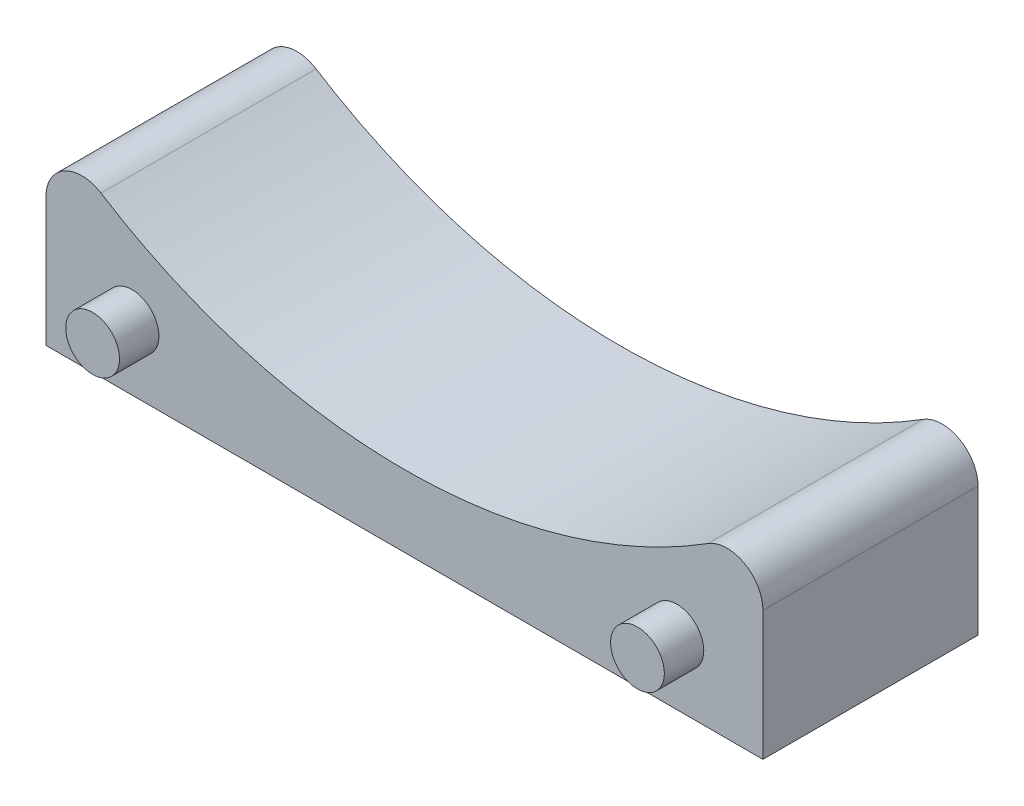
ISO-10303-21;
HEADER;
FILE_DESCRIPTION(('STEP AP214'),'2;1');
FILE_NAME('part.step','',(''),(''),'','','');
FILE_SCHEMA(('AUTOMOTIVE_DESIGN { 1 0 10303 214 1 1 1 1 }'));
ENDSEC;
DATA;
#1=APPLICATION_CONTEXT('core data for automotive mechanical design processes');
#2=APPLICATION_PROTOCOL_DEFINITION('international standard','automotive_design',2000,#1);
#3=PRODUCT_CONTEXT('',#1,'mechanical');
#4=PRODUCT('Part','Part','',(#3));
#5=PRODUCT_RELATED_PRODUCT_CATEGORY('part','',(#4));
#6=PRODUCT_DEFINITION_FORMATION('','',#4);
#7=PRODUCT_DEFINITION_CONTEXT('part definition',#1,'design');
#8=PRODUCT_DEFINITION('design','',#6,#7);
#9=PRODUCT_DEFINITION_SHAPE('','',#8);
#10=(LENGTH_UNIT() NAMED_UNIT(*) SI_UNIT(.MILLI.,.METRE.));
#11=(NAMED_UNIT(*) PLANE_ANGLE_UNIT() SI_UNIT($,.RADIAN.));
#12=(NAMED_UNIT(*) SI_UNIT($,.STERADIAN.) SOLID_ANGLE_UNIT());
#13=UNCERTAINTY_MEASURE_WITH_UNIT(LENGTH_MEASURE(1.E-05),#10,'distance_accuracy_value','');
#14=(GEOMETRIC_REPRESENTATION_CONTEXT(3) GLOBAL_UNCERTAINTY_ASSIGNED_CONTEXT((#13)) GLOBAL_UNIT_ASSIGNED_CONTEXT((#10,
#11,#12)) REPRESENTATION_CONTEXT('',''));
#15=CARTESIAN_POINT('',(0.,0.,0.));
#16=DIRECTION('',(0.,0.,1.));
#17=DIRECTION('',(1.,0.,0.));
#18=AXIS2_PLACEMENT_3D('',#15,#16,#17);
#19=CARTESIAN_POINT('',(0.,0.,0.));
#20=DIRECTION('',(0.,1.,0.));
#21=DIRECTION('',(0.,0.,1.));
#22=AXIS2_PLACEMENT_3D('',#19,#20,#21);
#23=PLANE('',#22);
#24=DIRECTION('',(0.,0.,-1.));
#25=VECTOR('',#24,1.);
#26=CARTESIAN_POINT('',(-50.,0.,144.));
#27=LINE('',#26,#25);
#28=CARTESIAN_POINT('',(-50.,0.,100.));
#29=VERTEX_POINT('',#28);
#30=CARTESIAN_POINT('',(-50.,0.,70.));
#31=VERTEX_POINT('',#30);
#32=EDGE_CURVE('E106',#29,#31,#27,.T.);
#33=ORIENTED_EDGE('',*,*,#32,.T.);
#34=DIRECTION('',(1.,0.,0.));
#35=VECTOR('',#34,1.);
#36=CARTESIAN_POINT('',(0.,0.,70.));
#37=LINE('',#36,#35);
#38=CARTESIAN_POINT('',(50.,0.,70.));
#39=VERTEX_POINT('',#38);
#40=EDGE_CURVE('E129',#31,#39,#37,.T.);
#41=ORIENTED_EDGE('',*,*,#40,.T.);
#42=DIRECTION('',(0.,0.,-1.));
#43=VECTOR('',#42,1.);
#44=CARTESIAN_POINT('',(50.,0.,144.));
#45=LINE('',#44,#43);
#46=CARTESIAN_POINT('',(50.,0.,100.));
#47=VERTEX_POINT('',#46);
#48=EDGE_CURVE('E109',#47,#39,#45,.T.);
#49=ORIENTED_EDGE('',*,*,#48,.F.);
#50=DIRECTION('',(1.,0.,0.));
#51=VECTOR('',#50,1.);
#52=CARTESIAN_POINT('',(0.,0.,100.));
#53=LINE('',#52,#51);
#54=EDGE_CURVE('E118',#29,#47,#53,.T.);
#55=ORIENTED_EDGE('',*,*,#54,.F.);
#56=EDGE_LOOP('',(#33,#41,#49,#55));
#57=FACE_BOUND('',#56,.T.);
#58=ADVANCED_FACE('F35',(#57),#23,.F.);
#59=CARTESIAN_POINT('',(-50.,24.,144.));
#60=DIRECTION('',(1.,0.,0.));
#61=DIRECTION('',(0.,0.,-1.));
#62=AXIS2_PLACEMENT_3D('',#59,#60,#61);
#63=PLANE('',#62);
#64=DIRECTION('',(0.,0.,1.));
#65=VECTOR('',#64,1.);
#66=CARTESIAN_POINT('',(-50.,18.0115182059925,134.437685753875));
#67=LINE('',#66,#65);
#68=CARTESIAN_POINT('',(-50.,18.0115182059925,100.));
#69=VERTEX_POINT('',#68);
#70=CARTESIAN_POINT('',(-50.,18.0115182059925,70.));
#71=VERTEX_POINT('',#70);
#72=EDGE_CURVE('E99',#69,#71,#67,.F.);
#73=ORIENTED_EDGE('',*,*,#72,.T.);
#74=DIRECTION('',(0.,-1.,0.));
#75=VECTOR('',#74,1.);
#76=CARTESIAN_POINT('',(-50.,24.,70.));
#77=LINE('',#76,#75);
#78=EDGE_CURVE('E49',#71,#31,#77,.T.);
#79=ORIENTED_EDGE('',*,*,#78,.T.);
#80=ORIENTED_EDGE('',*,*,#32,.F.);
#81=DIRECTION('',(0.,-1.,0.));
#82=VECTOR('',#81,1.);
#83=CARTESIAN_POINT('',(-50.,24.,100.));
#84=LINE('',#83,#82);
#85=EDGE_CURVE('E120',#69,#29,#84,.T.);
#86=ORIENTED_EDGE('',*,*,#85,.F.);
#87=EDGE_LOOP('',(#73,#79,#80,#86));
#88=FACE_BOUND('',#87,.T.);
#89=ADVANCED_FACE('F189',(#88),#63,.F.);
#90=CARTESIAN_POINT('',(50.,0.,144.));
#91=DIRECTION('',(-1.,0.,0.));
#92=DIRECTION('',(0.,0.,1.));
#93=AXIS2_PLACEMENT_3D('',#90,#91,#92);
#94=PLANE('',#93);
#95=ORIENTED_EDGE('',*,*,#48,.T.);
#96=DIRECTION('',(0.,1.,0.));
#97=VECTOR('',#96,1.);
#98=CARTESIAN_POINT('',(50.,0.,70.));
#99=LINE('',#98,#97);
#100=CARTESIAN_POINT('',(50.,18.0115182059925,70.));
#101=VERTEX_POINT('',#100);
#102=EDGE_CURVE('E124',#39,#101,#99,.T.);
#103=ORIENTED_EDGE('',*,*,#102,.T.);
#104=DIRECTION('',(0.,0.,1.));
#105=VECTOR('',#104,1.);
#106=CARTESIAN_POINT('',(50.,18.0115182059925,144.));
#107=LINE('',#106,#105);
#108=CARTESIAN_POINT('',(50.,18.0115182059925,100.));
#109=VERTEX_POINT('',#108);
#110=EDGE_CURVE('E102',#101,#109,#107,.T.);
#111=ORIENTED_EDGE('',*,*,#110,.T.);
#112=DIRECTION('',(0.,1.,0.));
#113=VECTOR('',#112,1.);
#114=CARTESIAN_POINT('',(50.,0.,100.));
#115=LINE('',#114,#113);
#116=EDGE_CURVE('E112',#47,#109,#115,.T.);
#117=ORIENTED_EDGE('',*,*,#116,.F.);
#118=EDGE_LOOP('',(#95,#103,#111,#117));
#119=FACE_BOUND('',#118,.T.);
#120=ADVANCED_FACE('F195',(#119),#94,.F.);
#121=CARTESIAN_POINT('',(0.,89.3214285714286,552.048566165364));
#122=DIRECTION('',(0.,0.,-1.));
#123=DIRECTION('',(-1.,0.,0.));
#124=AXIS2_PLACEMENT_3D('',#121,#122,#123);
#125=CYLINDRICAL_SURFACE('',#124,79.3214285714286);
#126=CARTESIAN_POINT('',(0.,89.3214285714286,70.));
#127=DIRECTION('',(0.,0.,1.));
#128=DIRECTION('',(1.,0.,0.));
#129=AXIS2_PLACEMENT_3D('',#126,#127,#128);
#130=CIRCLE('',#129,79.3214285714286);
#131=CARTESIAN_POINT('',(-42.3316391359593,22.2399754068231,70.));
#132=VERTEX_POINT('',#131);
#133=CARTESIAN_POINT('',(42.3316391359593,22.2399754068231,70.));
#134=VERTEX_POINT('',#133);
#135=EDGE_CURVE('E87',#132,#134,#130,.T.);
#136=ORIENTED_EDGE('',*,*,#135,.F.);
#137=DIRECTION('',(0.,0.,-1.));
#138=VECTOR('',#137,1.);
#139=CARTESIAN_POINT('',(-42.3316391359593,22.2399754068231,552.048566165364));
#140=LINE('',#139,#138);
#141=CARTESIAN_POINT('',(-42.3316391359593,22.2399754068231,100.));
#142=VERTEX_POINT('',#141);
#143=EDGE_CURVE('E57',#132,#142,#140,.F.);
#144=ORIENTED_EDGE('',*,*,#143,.T.);
#145=CARTESIAN_POINT('',(0.,89.3214285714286,100.));
#146=DIRECTION('',(0.,0.,1.));
#147=DIRECTION('',(1.,0.,0.));
#148=AXIS2_PLACEMENT_3D('',#145,#146,#147);
#149=CIRCLE('',#148,79.3214285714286);
#150=CARTESIAN_POINT('',(42.3316391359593,22.2399754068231,100.));
#151=VERTEX_POINT('',#150);
#152=EDGE_CURVE('E122',#142,#151,#149,.T.);
#153=ORIENTED_EDGE('',*,*,#152,.T.);
#154=DIRECTION('',(0.,0.,-1.));
#155=VECTOR('',#154,1.);
#156=CARTESIAN_POINT('',(42.3316391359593,22.2399754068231,552.048566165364));
#157=LINE('',#156,#155);
#158=EDGE_CURVE('E95',#151,#134,#157,.T.);
#159=ORIENTED_EDGE('',*,*,#158,.T.);
#160=EDGE_LOOP('',(#136,#144,#153,#159));
#161=FACE_BOUND('',#160,.T.);
#162=ADVANCED_FACE('F93',(#161),#125,.F.);
#163=CARTESIAN_POINT('',(45.,18.0115182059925,552.048566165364));
#164=DIRECTION('',(0.,0.,-1.));
#165=DIRECTION('',(-1.,0.,0.));
#166=AXIS2_PLACEMENT_3D('',#163,#164,#165);
#167=CYLINDRICAL_SURFACE('',#166,5.);
#168=CARTESIAN_POINT('',(45.,18.0115182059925,70.));
#169=DIRECTION('',(0.,0.,1.));
#170=DIRECTION('',(1.,0.,0.));
#171=AXIS2_PLACEMENT_3D('',#168,#169,#170);
#172=CIRCLE('',#171,5.);
#173=EDGE_CURVE('E127',#134,#101,#172,.F.);
#174=ORIENTED_EDGE('',*,*,#173,.F.);
#175=ORIENTED_EDGE('',*,*,#158,.F.);
#176=CARTESIAN_POINT('',(45.,18.0115182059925,100.));
#177=DIRECTION('',(0.,0.,1.));
#178=DIRECTION('',(1.,0.,0.));
#179=AXIS2_PLACEMENT_3D('',#176,#177,#178);
#180=CIRCLE('',#179,5.);
#181=EDGE_CURVE('E115',#151,#109,#180,.F.);
#182=ORIENTED_EDGE('',*,*,#181,.T.);
#183=ORIENTED_EDGE('',*,*,#110,.F.);
#184=EDGE_LOOP('',(#174,#175,#182,#183));
#185=FACE_BOUND('',#184,.T.);
#186=ADVANCED_FACE('F199',(#185),#167,.T.);
#187=CARTESIAN_POINT('',(-45.,18.0115182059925,552.048566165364));
#188=DIRECTION('',(0.,0.,-1.));
#189=DIRECTION('',(-1.,0.,0.));
#190=AXIS2_PLACEMENT_3D('',#187,#188,#189);
#191=CYLINDRICAL_SURFACE('',#190,5.);
#192=CARTESIAN_POINT('',(-45.,18.0115182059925,70.));
#193=DIRECTION('',(0.,0.,1.));
#194=DIRECTION('',(1.,0.,0.));
#195=AXIS2_PLACEMENT_3D('',#192,#193,#194);
#196=CIRCLE('',#195,5.);
#197=EDGE_CURVE('E11',#71,#132,#196,.F.);
#198=ORIENTED_EDGE('',*,*,#197,.F.);
#199=ORIENTED_EDGE('',*,*,#72,.F.);
#200=CARTESIAN_POINT('',(-45.,18.0115182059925,100.));
#201=DIRECTION('',(0.,0.,1.));
#202=DIRECTION('',(1.,0.,0.));
#203=AXIS2_PLACEMENT_3D('',#200,#201,#202);
#204=CIRCLE('',#203,5.);
#205=EDGE_CURVE('E43',#69,#142,#204,.F.);
#206=ORIENTED_EDGE('',*,*,#205,.T.);
#207=ORIENTED_EDGE('',*,*,#143,.F.);
#208=EDGE_LOOP('',(#198,#199,#206,#207));
#209=FACE_BOUND('',#208,.T.);
#210=ADVANCED_FACE('F37',(#209),#191,.T.);
#211=CARTESIAN_POINT('',(0.,0.,100.));
#212=DIRECTION('',(0.,0.,1.));
#213=DIRECTION('',(1.,0.,0.));
#214=AXIS2_PLACEMENT_3D('',#211,#212,#213);
#215=PLANE('',#214);
#216=CARTESIAN_POINT('',(38.,9.,100.));
#217=DIRECTION('',(0.,0.,1.));
#218=DIRECTION('',(1.,0.,0.));
#219=AXIS2_PLACEMENT_3D('',#216,#217,#218);
#220=CIRCLE('',#219,3.75000000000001);
#221=CARTESIAN_POINT('',(41.75,9.,100.));
#222=VERTEX_POINT('',#221);
#223=EDGE_CURVE('E139',#222,#222,#220,.T.);
#224=ORIENTED_EDGE('',*,*,#223,.F.);
#225=EDGE_LOOP('',(#224));
#226=FACE_BOUND('',#225,.T.);
#227=CARTESIAN_POINT('',(-38.,9.,100.));
#228=DIRECTION('',(0.,0.,1.));
#229=DIRECTION('',(1.,0.,0.));
#230=AXIS2_PLACEMENT_3D('',#227,#228,#229);
#231=CIRCLE('',#230,3.75000000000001);
#232=CARTESIAN_POINT('',(-34.25,9.,100.));
#233=VERTEX_POINT('',#232);
#234=EDGE_CURVE('E133',#233,#233,#231,.T.);
#235=ORIENTED_EDGE('',*,*,#234,.F.);
#236=EDGE_LOOP('',(#235));
#237=FACE_BOUND('',#236,.T.);
#238=ORIENTED_EDGE('',*,*,#116,.T.);
#239=ORIENTED_EDGE('',*,*,#181,.F.);
#240=ORIENTED_EDGE('',*,*,#152,.F.);
#241=ORIENTED_EDGE('',*,*,#205,.F.);
#242=ORIENTED_EDGE('',*,*,#85,.T.);
#243=ORIENTED_EDGE('',*,*,#54,.T.);
#244=EDGE_LOOP('',(#238,#239,#240,#241,#242,#243));
#245=FACE_BOUND('',#244,.T.);
#246=ADVANCED_FACE('F169',(#226,#237,#245),#215,.T.);
#247=CARTESIAN_POINT('',(0.,0.,70.));
#248=DIRECTION('',(0.,0.,1.));
#249=DIRECTION('',(1.,0.,0.));
#250=AXIS2_PLACEMENT_3D('',#247,#248,#249);
#251=PLANE('',#250);
#252=CARTESIAN_POINT('',(-38.,9.,70.));
#253=DIRECTION('',(0.,0.,-1.));
#254=DIRECTION('',(-1.,0.,0.));
#255=AXIS2_PLACEMENT_3D('',#252,#253,#254);
#256=CIRCLE('',#255,4.);
#257=CARTESIAN_POINT('',(-42.,9.,70.));
#258=VERTEX_POINT('',#257);
#259=EDGE_CURVE('E151',#258,#258,#256,.T.);
#260=ORIENTED_EDGE('',*,*,#259,.F.);
#261=EDGE_LOOP('',(#260));
#262=FACE_BOUND('',#261,.T.);
#263=CARTESIAN_POINT('',(38.,9.,70.));
#264=DIRECTION('',(0.,0.,-1.));
#265=DIRECTION('',(-1.,0.,0.));
#266=AXIS2_PLACEMENT_3D('',#263,#264,#265);
#267=CIRCLE('',#266,4.00000000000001);
#268=CARTESIAN_POINT('',(34.,9.,70.));
#269=VERTEX_POINT('',#268);
#270=EDGE_CURVE('E145',#269,#269,#267,.T.);
#271=ORIENTED_EDGE('',*,*,#270,.F.);
#272=EDGE_LOOP('',(#271));
#273=FACE_BOUND('',#272,.T.);
#274=ORIENTED_EDGE('',*,*,#40,.F.);
#275=ORIENTED_EDGE('',*,*,#78,.F.);
#276=ORIENTED_EDGE('',*,*,#197,.T.);
#277=ORIENTED_EDGE('',*,*,#135,.T.);
#278=ORIENTED_EDGE('',*,*,#173,.T.);
#279=ORIENTED_EDGE('',*,*,#102,.F.);
#280=EDGE_LOOP('',(#274,#275,#276,#277,#278,#279));
#281=FACE_BOUND('',#280,.T.);
#282=ADVANCED_FACE('F86',(#262,#273,#281),#251,.F.);
#283=CARTESIAN_POINT('',(-38.,9.,105.5));
#284=DIRECTION('',(0.,0.,-1.));
#285=DIRECTION('',(-1.,0.,0.));
#286=AXIS2_PLACEMENT_3D('',#283,#284,#285);
#287=CYLINDRICAL_SURFACE('',#286,3.75000000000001);
#288=CARTESIAN_POINT('',(-38.,9.,105.5));
#289=DIRECTION('',(0.,0.,1.));
#290=DIRECTION('',(1.,0.,0.));
#291=AXIS2_PLACEMENT_3D('',#288,#289,#290);
#292=CIRCLE('',#291,3.75000000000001);
#293=CARTESIAN_POINT('',(-34.25,9.,105.5));
#294=VERTEX_POINT('',#293);
#295=EDGE_CURVE('E96',#294,#294,#292,.T.);
#296=ORIENTED_EDGE('',*,*,#295,.F.);
#297=EDGE_LOOP('',(#296));
#298=FACE_BOUND('',#297,.T.);
#299=ORIENTED_EDGE('',*,*,#234,.T.);
#300=EDGE_LOOP('',(#299));
#301=FACE_BOUND('',#300,.T.);
#302=ADVANCED_FACE('F168',(#298,#301),#287,.T.);
#303=CARTESIAN_POINT('',(-38.,9.,105.5));
#304=DIRECTION('',(0.,0.,1.));
#305=DIRECTION('',(1.,0.,0.));
#306=AXIS2_PLACEMENT_3D('',#303,#304,#305);
#307=PLANE('',#306);
#308=ORIENTED_EDGE('',*,*,#295,.T.);
#309=EDGE_LOOP('',(#308));
#310=FACE_BOUND('',#309,.T.);
#311=ADVANCED_FACE('F277',(#310),#307,.T.);
#312=CARTESIAN_POINT('',(38.,9.,105.5));
#313=DIRECTION('',(0.,0.,-1.));
#314=DIRECTION('',(-1.,0.,0.));
#315=AXIS2_PLACEMENT_3D('',#312,#313,#314);
#316=CYLINDRICAL_SURFACE('',#315,3.75000000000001);
#317=CARTESIAN_POINT('',(38.,9.,105.5));
#318=DIRECTION('',(0.,0.,1.));
#319=DIRECTION('',(1.,0.,0.));
#320=AXIS2_PLACEMENT_3D('',#317,#318,#319);
#321=CIRCLE('',#320,3.75000000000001);
#322=CARTESIAN_POINT('',(41.75,9.,105.5));
#323=VERTEX_POINT('',#322);
#324=EDGE_CURVE('E136',#323,#323,#321,.T.);
#325=ORIENTED_EDGE('',*,*,#324,.F.);
#326=EDGE_LOOP('',(#325));
#327=FACE_BOUND('',#326,.T.);
#328=ORIENTED_EDGE('',*,*,#223,.T.);
#329=EDGE_LOOP('',(#328));
#330=FACE_BOUND('',#329,.T.);
#331=ADVANCED_FACE('F184',(#327,#330),#316,.T.);
#332=CARTESIAN_POINT('',(38.,9.,105.5));
#333=DIRECTION('',(0.,0.,1.));
#334=DIRECTION('',(1.,0.,0.));
#335=AXIS2_PLACEMENT_3D('',#332,#333,#334);
#336=PLANE('',#335);
#337=ORIENTED_EDGE('',*,*,#324,.T.);
#338=EDGE_LOOP('',(#337));
#339=FACE_BOUND('',#338,.T.);
#340=ADVANCED_FACE('F175',(#339),#336,.T.);
#341=CARTESIAN_POINT('',(38.,9.,76.));
#342=DIRECTION('',(0.,0.,-1.));
#343=DIRECTION('',(-1.,0.,0.));
#344=AXIS2_PLACEMENT_3D('',#341,#342,#343);
#345=CYLINDRICAL_SURFACE('',#344,4.00000000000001);
#346=CARTESIAN_POINT('',(38.,9.,76.));
#347=DIRECTION('',(0.,0.,-1.));
#348=DIRECTION('',(-1.,0.,0.));
#349=AXIS2_PLACEMENT_3D('',#346,#347,#348);
#350=CIRCLE('',#349,4.00000000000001);
#351=CARTESIAN_POINT('',(34.,9.,76.));
#352=VERTEX_POINT('',#351);
#353=EDGE_CURVE('E142',#352,#352,#350,.T.);
#354=ORIENTED_EDGE('',*,*,#353,.F.);
#355=EDGE_LOOP('',(#354));
#356=FACE_BOUND('',#355,.T.);
#357=ORIENTED_EDGE('',*,*,#270,.T.);
#358=EDGE_LOOP('',(#357));
#359=FACE_BOUND('',#358,.T.);
#360=ADVANCED_FACE('F173',(#356,#359),#345,.F.);
#361=CARTESIAN_POINT('',(38.,9.,76.));
#362=DIRECTION('',(0.,0.,-1.));
#363=DIRECTION('',(-1.,0.,0.));
#364=AXIS2_PLACEMENT_3D('',#361,#362,#363);
#365=PLANE('',#364);
#366=ORIENTED_EDGE('',*,*,#353,.T.);
#367=EDGE_LOOP('',(#366));
#368=FACE_BOUND('',#367,.T.);
#369=ADVANCED_FACE('F162',(#368),#365,.T.);
#370=CARTESIAN_POINT('',(-38.,9.,76.));
#371=DIRECTION('',(0.,0.,-1.));
#372=DIRECTION('',(-1.,0.,0.));
#373=AXIS2_PLACEMENT_3D('',#370,#371,#372);
#374=CYLINDRICAL_SURFACE('',#373,4.);
#375=CARTESIAN_POINT('',(-38.,9.,76.));
#376=DIRECTION('',(0.,0.,-1.));
#377=DIRECTION('',(-1.,0.,0.));
#378=AXIS2_PLACEMENT_3D('',#375,#376,#377);
#379=CIRCLE('',#378,4.);
#380=CARTESIAN_POINT('',(-42.,9.,76.));
#381=VERTEX_POINT('',#380);
#382=EDGE_CURVE('E148',#381,#381,#379,.T.);
#383=ORIENTED_EDGE('',*,*,#382,.F.);
#384=EDGE_LOOP('',(#383));
#385=FACE_BOUND('',#384,.T.);
#386=ORIENTED_EDGE('',*,*,#259,.T.);
#387=EDGE_LOOP('',(#386));
#388=FACE_BOUND('',#387,.T.);
#389=ADVANCED_FACE('F159',(#385,#388),#374,.F.);
#390=CARTESIAN_POINT('',(-38.,9.,76.));
#391=DIRECTION('',(0.,0.,-1.));
#392=DIRECTION('',(-1.,0.,0.));
#393=AXIS2_PLACEMENT_3D('',#390,#391,#392);
#394=PLANE('',#393);
#395=ORIENTED_EDGE('',*,*,#382,.T.);
#396=EDGE_LOOP('',(#395));
#397=FACE_BOUND('',#396,.T.);
#398=ADVANCED_FACE('F157',(#397),#394,.T.);
#399=CLOSED_SHELL('',(#58,#89,#120,#162,#186,#210,#246,#282,#302,#311,#331,#340,#360,#369,#389,#398));
#400=MANIFOLD_SOLID_BREP('B2',#399);
#401=ADVANCED_BREP_SHAPE_REPRESENTATION('',(#18,#400),#14);
#402=SHAPE_DEFINITION_REPRESENTATION(#9,#401);
ENDSEC;
END-ISO-10303-21;
